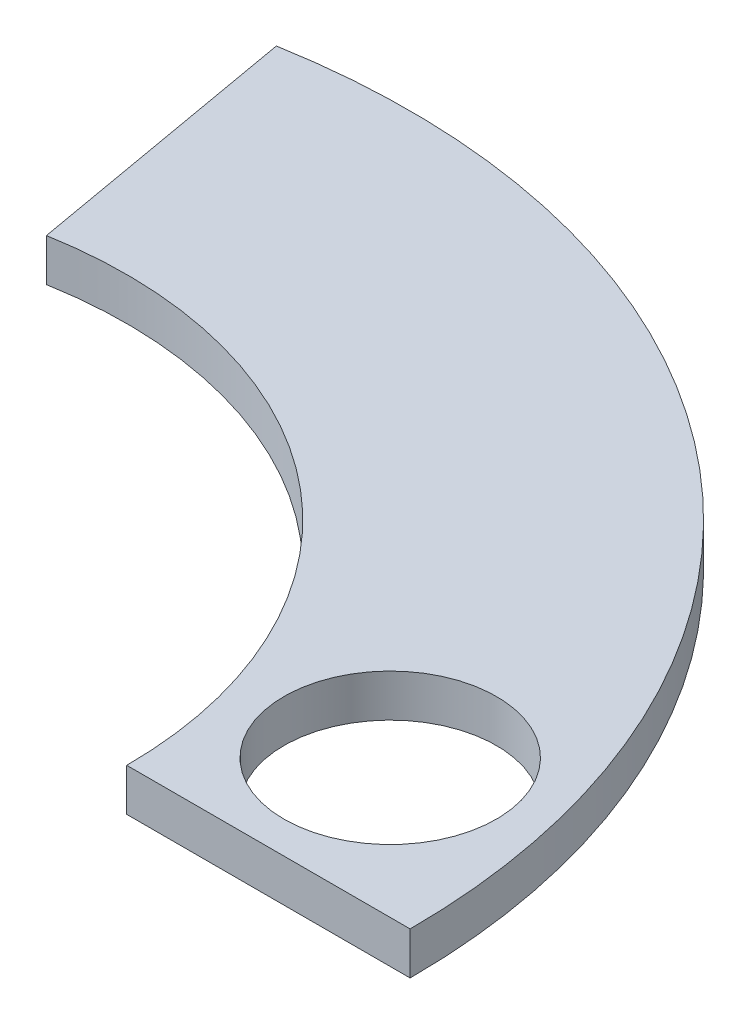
from build123d import *

# Parameters (mm, degrees)
SKETCH1_R           = 7.5
BOSS_EXTRUDE1_DEPTH = 3


with BuildPart() as part:
    # Sketch1 → Boss-Extrude1 (new body)
    with BuildSketch(Plane(origin=(0, 0, 0), x_dir=(1, 0, 0), z_dir=(0, 1, 0))):
        with BuildLine():
            Line((-8.682408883, 49.240387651), (-5.20944533, 29.54423259))
            ThreePointArc((-5.20944533, 29.54423259), (19.283628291, 22.981333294), (30, 0))
            Line((30, 0), (50, 0))
            ThreePointArc((50, 0), (32.139380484, 38.302222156), (-8.682408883, 49.240387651))
        make_face()
        with Locations(Location((38.838820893, 9.755736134, 0), (0, 0, 270))):
            Circle(SKETCH1_R, mode=Mode.SUBTRACT)
    extrude(amount=BOSS_EXTRUDE1_DEPTH)


solid = part.part
